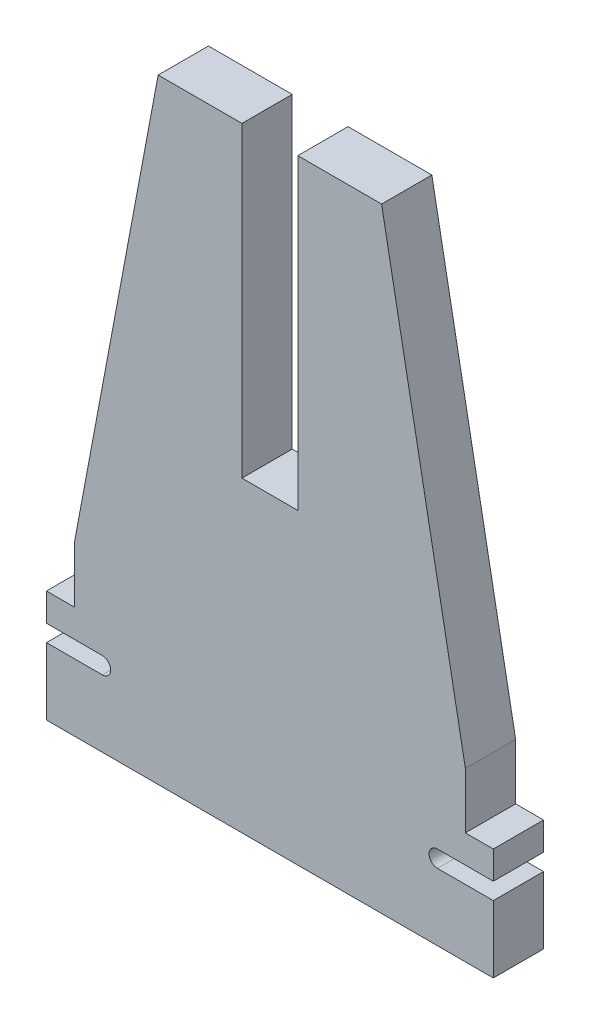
from build123d import *

# Parameters (mm, degrees)
BOSS_EXTRU_1_DEPTH      = 9
ESQUISSE2_W             = 10
ESQUISSE2_H             = 55
ENL_V_MAT_EXTRU_1_DEPTH = 134.439124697
ENL_V_MAT_EXTRU_2_DEPTH = 10


with BuildPart() as part:
    # Esquisse1 → Boss.-Extru.1 (new body)
    with BuildSketch(Plane.XY):
        Polygon((0, 20), (0, 30), (-15, 110), (-55, 110), (-70, 30), (-70, 20), (-75, 20), (-75, 0), (0, 0), (5, 0), (5, 20), align=None)
    extrude(amount=-BOSS_EXTRU_1_DEPTH)

    # Esquisse2 → Enl_v. mat.-Extru.1 (cut, through all)
    with BuildSketch(Plane.XY):
        with Locations((-35, 82.5)):
            Rectangle(ESQUISSE2_W, ESQUISSE2_H)
    extrude(amount=-ENL_V_MAT_EXTRU_1_DEPTH, mode=Mode.SUBTRACT)

    # Esquisse3 → Enl_v. mat.-Extru.2 (cut)
    with BuildSketch(Plane.XY):
        with BuildLine():
            Line((5, 15), (-5, 15))
            ThreePointArc((-5, 15), (-6.5, 13.5), (-5, 12))
            Line((-5, 12), (5, 12))
            Line((5, 12), (5, 15))
        make_face()
        with BuildLine():
            Line((-65, 12), (-75, 12))
            Line((-75, 12), (-75, 15))
            Line((-75, 15), (-65, 15))
            ThreePointArc((-65, 15), (-63.5, 13.5), (-65, 12))
        make_face()
    extrude(amount=-ENL_V_MAT_EXTRU_2_DEPTH, mode=Mode.SUBTRACT)


solid = part.part
